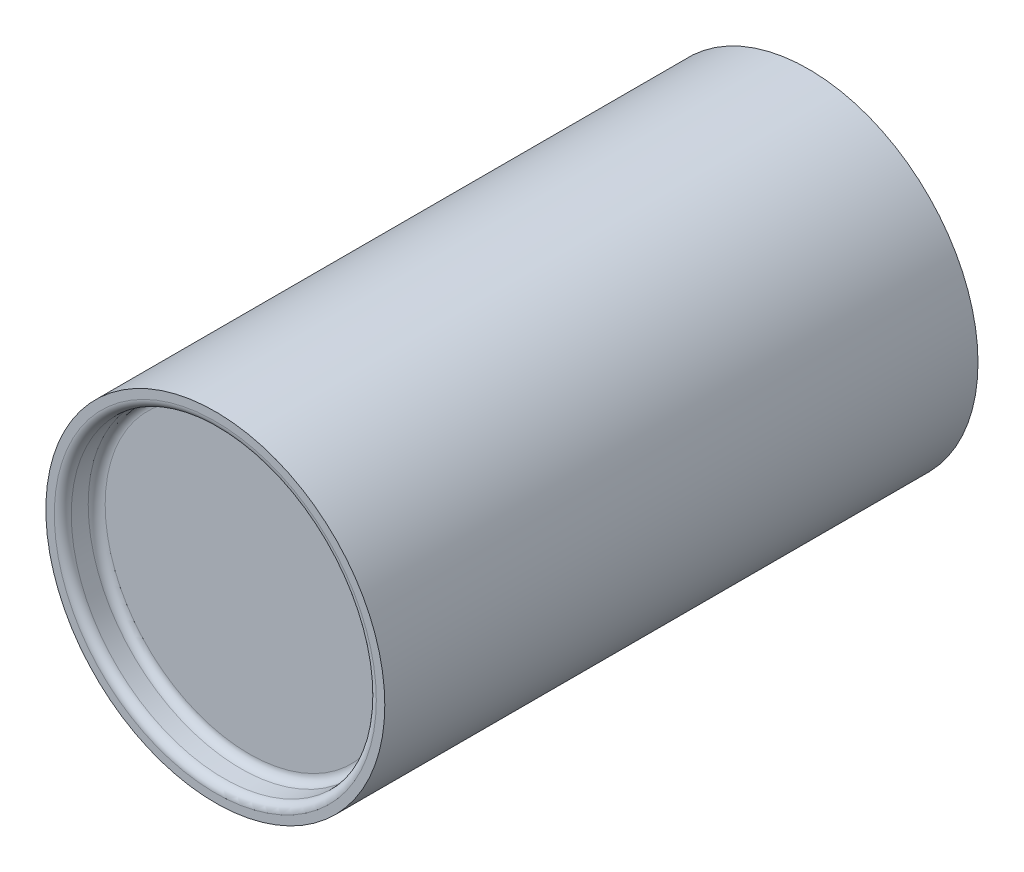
ISO-10303-21;
HEADER;
FILE_DESCRIPTION(('STEP AP214'),'2;1');
FILE_NAME('part.step','',(''),(''),'','','');
FILE_SCHEMA(('AUTOMOTIVE_DESIGN { 1 0 10303 214 1 1 1 1 }'));
ENDSEC;
DATA;
#1=APPLICATION_CONTEXT('core data for automotive mechanical design processes');
#2=APPLICATION_PROTOCOL_DEFINITION('international standard','automotive_design',2000,#1);
#3=PRODUCT_CONTEXT('',#1,'mechanical');
#4=PRODUCT('Part','Part','',(#3));
#5=PRODUCT_RELATED_PRODUCT_CATEGORY('part','',(#4));
#6=PRODUCT_DEFINITION_FORMATION('','',#4);
#7=PRODUCT_DEFINITION_CONTEXT('part definition',#1,'design');
#8=PRODUCT_DEFINITION('design','',#6,#7);
#9=PRODUCT_DEFINITION_SHAPE('','',#8);
#10=(LENGTH_UNIT() NAMED_UNIT(*) SI_UNIT(.MILLI.,.METRE.));
#11=(NAMED_UNIT(*) PLANE_ANGLE_UNIT() SI_UNIT($,.RADIAN.));
#12=(NAMED_UNIT(*) SI_UNIT($,.STERADIAN.) SOLID_ANGLE_UNIT());
#13=UNCERTAINTY_MEASURE_WITH_UNIT(LENGTH_MEASURE(1.E-05),#10,'distance_accuracy_value','');
#14=(GEOMETRIC_REPRESENTATION_CONTEXT(3) GLOBAL_UNCERTAINTY_ASSIGNED_CONTEXT((#13)) GLOBAL_UNIT_ASSIGNED_CONTEXT((#10,
#11,#12)) REPRESENTATION_CONTEXT('',''));
#15=CARTESIAN_POINT('',(0.,0.,0.));
#16=DIRECTION('',(0.,0.,1.));
#17=DIRECTION('',(1.,0.,0.));
#18=AXIS2_PLACEMENT_3D('',#15,#16,#17);
#19=CARTESIAN_POINT('',(0.,0.,35.));
#20=DIRECTION('',(0.,0.,-1.));
#21=DIRECTION('',(-1.,0.,0.));
#22=AXIS2_PLACEMENT_3D('',#19,#20,#21);
#23=CYLINDRICAL_SURFACE('',#22,10.);
#24=CARTESIAN_POINT('',(0.,0.,35.));
#25=DIRECTION('',(0.,0.,1.));
#26=DIRECTION('',(1.,0.,0.));
#27=AXIS2_PLACEMENT_3D('',#24,#25,#26);
#28=CIRCLE('',#27,10.);
#29=CARTESIAN_POINT('',(10.,0.,35.));
#30=VERTEX_POINT('',#29);
#31=EDGE_CURVE('E63',#30,#30,#28,.T.);
#32=ORIENTED_EDGE('',*,*,#31,.F.);
#33=EDGE_LOOP('',(#32));
#34=FACE_BOUND('',#33,.T.);
#35=CARTESIAN_POINT('',(0.,0.,0.));
#36=DIRECTION('',(0.,0.,1.));
#37=DIRECTION('',(1.,0.,0.));
#38=AXIS2_PLACEMENT_3D('',#35,#36,#37);
#39=CIRCLE('',#38,10.);
#40=CARTESIAN_POINT('',(10.,0.,0.));
#41=VERTEX_POINT('',#40);
#42=EDGE_CURVE('E64',#41,#41,#39,.T.);
#43=ORIENTED_EDGE('',*,*,#42,.T.);
#44=EDGE_LOOP('',(#43));
#45=FACE_BOUND('',#44,.T.);
#46=ADVANCED_FACE('F31',(#34,#45),#23,.T.);
#47=CARTESIAN_POINT('',(0.,0.,35.));
#48=DIRECTION('',(0.,0.,1.));
#49=DIRECTION('',(1.,0.,0.));
#50=AXIS2_PLACEMENT_3D('',#47,#48,#49);
#51=PLANE('',#50);
#52=CARTESIAN_POINT('',(0.,0.,35.));
#53=DIRECTION('',(0.,0.,1.));
#54=DIRECTION('',(1.,0.,0.));
#55=AXIS2_PLACEMENT_3D('',#52,#53,#54);
#56=CIRCLE('',#55,9.5);
#57=CARTESIAN_POINT('',(9.5,0.,35.));
#58=VERTEX_POINT('',#57);
#59=EDGE_CURVE('E54',#58,#58,#56,.F.);
#60=ORIENTED_EDGE('',*,*,#59,.T.);
#61=EDGE_LOOP('',(#60));
#62=FACE_BOUND('',#61,.T.);
#63=ORIENTED_EDGE('',*,*,#31,.T.);
#64=EDGE_LOOP('',(#63));
#65=FACE_BOUND('',#64,.T.);
#66=ADVANCED_FACE('F70',(#62,#65),#51,.T.);
#67=CARTESIAN_POINT('',(0.,0.,0.));
#68=DIRECTION('',(0.,0.,1.));
#69=DIRECTION('',(1.,0.,0.));
#70=AXIS2_PLACEMENT_3D('',#67,#68,#69);
#71=PLANE('',#70);
#72=CARTESIAN_POINT('',(0.,0.,0.));
#73=DIRECTION('',(0.,0.,1.));
#74=DIRECTION('',(1.,0.,0.));
#75=AXIS2_PLACEMENT_3D('',#72,#73,#74);
#76=CIRCLE('',#75,9.5);
#77=CARTESIAN_POINT('',(9.5,0.,0.));
#78=VERTEX_POINT('',#77);
#79=EDGE_CURVE('E38',#78,#78,#76,.T.);
#80=ORIENTED_EDGE('',*,*,#79,.T.);
#81=EDGE_LOOP('',(#80));
#82=FACE_BOUND('',#81,.T.);
#83=ORIENTED_EDGE('',*,*,#42,.F.);
#84=EDGE_LOOP('',(#83));
#85=FACE_BOUND('',#84,.T.);
#86=ADVANCED_FACE('F77',(#82,#85),#71,.F.);
#87=CARTESIAN_POINT('',(0.,0.,2.));
#88=DIRECTION('',(0.,0.,-1.));
#89=DIRECTION('',(-1.,0.,0.));
#90=AXIS2_PLACEMENT_3D('',#87,#88,#89);
#91=CYLINDRICAL_SURFACE('',#90,9.);
#92=CARTESIAN_POINT('',(0.,0.,0.5));
#93=DIRECTION('',(0.,0.,1.));
#94=DIRECTION('',(1.,0.,0.));
#95=AXIS2_PLACEMENT_3D('',#92,#93,#94);
#96=CIRCLE('',#95,9.);
#97=CARTESIAN_POINT('',(9.,0.,0.5));
#98=VERTEX_POINT('',#97);
#99=EDGE_CURVE('E42',#98,#98,#96,.F.);
#100=ORIENTED_EDGE('',*,*,#99,.T.);
#101=EDGE_LOOP('',(#100));
#102=FACE_BOUND('',#101,.T.);
#103=CARTESIAN_POINT('',(0.,0.,1.5));
#104=DIRECTION('',(0.,0.,-1.));
#105=DIRECTION('',(-1.,0.,0.));
#106=AXIS2_PLACEMENT_3D('',#103,#104,#105);
#107=CIRCLE('',#106,9.);
#108=CARTESIAN_POINT('',(-9.,0.,1.5));
#109=VERTEX_POINT('',#108);
#110=EDGE_CURVE('E46',#109,#109,#107,.F.);
#111=ORIENTED_EDGE('',*,*,#110,.T.);
#112=EDGE_LOOP('',(#111));
#113=FACE_BOUND('',#112,.T.);
#114=ADVANCED_FACE('F79',(#102,#113),#91,.F.);
#115=CARTESIAN_POINT('',(0.,0.,2.));
#116=DIRECTION('',(0.,0.,-1.));
#117=DIRECTION('',(-1.,0.,0.));
#118=AXIS2_PLACEMENT_3D('',#115,#116,#117);
#119=PLANE('',#118);
#120=CARTESIAN_POINT('',(0.,0.,2.));
#121=DIRECTION('',(0.,0.,-1.));
#122=DIRECTION('',(-1.,0.,0.));
#123=AXIS2_PLACEMENT_3D('',#120,#121,#122);
#124=CIRCLE('',#123,8.5);
#125=CARTESIAN_POINT('',(-8.5,0.,2.));
#126=VERTEX_POINT('',#125);
#127=EDGE_CURVE('E10',#126,#126,#124,.T.);
#128=ORIENTED_EDGE('',*,*,#127,.T.);
#129=EDGE_LOOP('',(#128));
#130=FACE_BOUND('',#129,.T.);
#131=ADVANCED_FACE('F85',(#130),#119,.T.);
#132=CARTESIAN_POINT('',(0.,0.,33.));
#133=DIRECTION('',(0.,0.,1.));
#134=DIRECTION('',(1.,0.,0.));
#135=AXIS2_PLACEMENT_3D('',#132,#133,#134);
#136=CYLINDRICAL_SURFACE('',#135,9.);
#137=CARTESIAN_POINT('',(0.,0.,34.5));
#138=DIRECTION('',(0.,0.,1.));
#139=DIRECTION('',(1.,0.,0.));
#140=AXIS2_PLACEMENT_3D('',#137,#138,#139);
#141=CIRCLE('',#140,9.);
#142=CARTESIAN_POINT('',(9.,0.,34.5));
#143=VERTEX_POINT('',#142);
#144=EDGE_CURVE('E57',#143,#143,#141,.T.);
#145=ORIENTED_EDGE('',*,*,#144,.T.);
#146=EDGE_LOOP('',(#145));
#147=FACE_BOUND('',#146,.T.);
#148=CARTESIAN_POINT('',(0.,0.,33.5));
#149=DIRECTION('',(0.,0.,1.));
#150=DIRECTION('',(1.,0.,0.));
#151=AXIS2_PLACEMENT_3D('',#148,#149,#150);
#152=CIRCLE('',#151,9.);
#153=CARTESIAN_POINT('',(9.,0.,33.5));
#154=VERTEX_POINT('',#153);
#155=EDGE_CURVE('E60',#154,#154,#152,.F.);
#156=ORIENTED_EDGE('',*,*,#155,.T.);
#157=EDGE_LOOP('',(#156));
#158=FACE_BOUND('',#157,.T.);
#159=ADVANCED_FACE('F138',(#147,#158),#136,.F.);
#160=CARTESIAN_POINT('',(0.,0.,33.));
#161=DIRECTION('',(0.,0.,1.));
#162=DIRECTION('',(1.,0.,0.));
#163=AXIS2_PLACEMENT_3D('',#160,#161,#162);
#164=PLANE('',#163);
#165=CARTESIAN_POINT('',(0.,0.,33.));
#166=DIRECTION('',(0.,0.,1.));
#167=DIRECTION('',(1.,0.,0.));
#168=AXIS2_PLACEMENT_3D('',#165,#166,#167);
#169=CIRCLE('',#168,8.5);
#170=CARTESIAN_POINT('',(8.5,0.,33.));
#171=VERTEX_POINT('',#170);
#172=EDGE_CURVE('E51',#171,#171,#169,.T.);
#173=ORIENTED_EDGE('',*,*,#172,.T.);
#174=EDGE_LOOP('',(#173));
#175=FACE_BOUND('',#174,.T.);
#176=ADVANCED_FACE('F95',(#175),#164,.T.);
#177=CARTESIAN_POINT('',(0.,0.,34.5));
#178=DIRECTION('',(0.,0.,1.));
#179=DIRECTION('',(1.,0.,0.));
#180=AXIS2_PLACEMENT_3D('',#177,#178,#179);
#181=TOROIDAL_SURFACE('',#180,9.5,0.5);
#182=ORIENTED_EDGE('',*,*,#59,.F.);
#183=EDGE_LOOP('',(#182));
#184=FACE_BOUND('',#183,.T.);
#185=ORIENTED_EDGE('',*,*,#144,.F.);
#186=EDGE_LOOP('',(#185));
#187=FACE_BOUND('',#186,.T.);
#188=ADVANCED_FACE('F91',(#184,#187),#181,.T.);
#189=CARTESIAN_POINT('',(0.,0.,33.5));
#190=DIRECTION('',(0.,0.,1.));
#191=DIRECTION('',(1.,0.,0.));
#192=AXIS2_PLACEMENT_3D('',#189,#190,#191);
#193=TOROIDAL_SURFACE('',#192,8.5,0.5);
#194=ORIENTED_EDGE('',*,*,#155,.F.);
#195=EDGE_LOOP('',(#194));
#196=FACE_BOUND('',#195,.T.);
#197=ORIENTED_EDGE('',*,*,#172,.F.);
#198=EDGE_LOOP('',(#197));
#199=FACE_BOUND('',#198,.T.);
#200=ADVANCED_FACE('F94',(#196,#199),#193,.F.);
#201=CARTESIAN_POINT('',(0.,0.,0.5));
#202=DIRECTION('',(0.,0.,1.));
#203=DIRECTION('',(1.,0.,0.));
#204=AXIS2_PLACEMENT_3D('',#201,#202,#203);
#205=TOROIDAL_SURFACE('',#204,9.5,0.5);
#206=ORIENTED_EDGE('',*,*,#79,.F.);
#207=EDGE_LOOP('',(#206));
#208=FACE_BOUND('',#207,.T.);
#209=ORIENTED_EDGE('',*,*,#99,.F.);
#210=EDGE_LOOP('',(#209));
#211=FACE_BOUND('',#210,.T.);
#212=ADVANCED_FACE('F98',(#208,#211),#205,.T.);
#213=CARTESIAN_POINT('',(0.,0.,1.5));
#214=DIRECTION('',(0.,0.,-1.));
#215=DIRECTION('',(-1.,0.,0.));
#216=AXIS2_PLACEMENT_3D('',#213,#214,#215);
#217=TOROIDAL_SURFACE('',#216,8.5,0.5);
#218=ORIENTED_EDGE('',*,*,#110,.F.);
#219=EDGE_LOOP('',(#218));
#220=FACE_BOUND('',#219,.T.);
#221=ORIENTED_EDGE('',*,*,#127,.F.);
#222=EDGE_LOOP('',(#221));
#223=FACE_BOUND('',#222,.T.);
#224=ADVANCED_FACE('F33',(#220,#223),#217,.F.);
#225=CLOSED_SHELL('',(#46,#66,#86,#114,#131,#159,#176,#188,#200,#212,#224));
#226=MANIFOLD_SOLID_BREP('B2',#225);
#227=ADVANCED_BREP_SHAPE_REPRESENTATION('',(#18,#226),#14);
#228=SHAPE_DEFINITION_REPRESENTATION(#9,#227);
ENDSEC;
END-ISO-10303-21;
